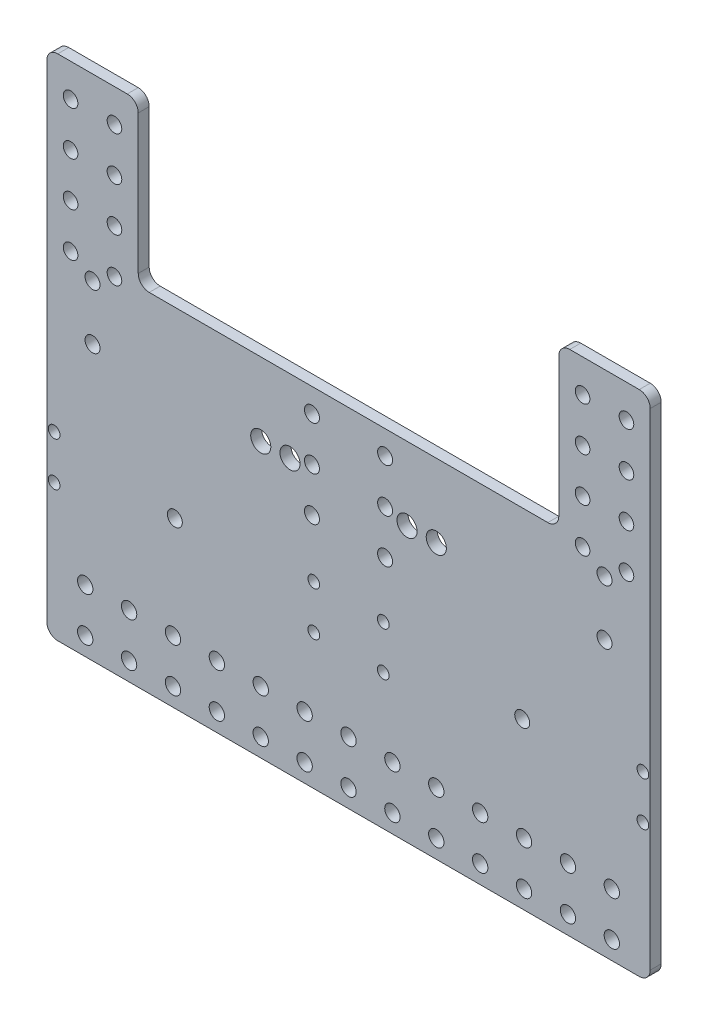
from build123d import *

# Parameters (mm, degrees)
SKETCH_1_W                = 165
SKETCH_1_H                = 430
SKETCH_1_R                = 2.05
EXTRUDE_1_DEPTH           = 3
CUT_EXTRUDE_1_DEPTH       = 231.304689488
CUT_EXTRUDE_1_DEPTH_BACK  = 231.304689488
SKETCH_2_R                = 1.6
SKETCH_6_W                = 77.5
SKETCH_6_H                = 180
EXTRUDE_2_DEPTH           = 3
FILLET_1_R                = 60
FILLET_2_R                = 20
FILLET_3_R                = 10
CUT_EXTRUDE_6_DEPTH       = 396.296091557
CUT_EXTRUDE_6_DEPTH_BACK  = 396.296091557
SKETCH_9_R                = 1.6
CUT_EXTRUDE_7_DEPTH       = 396.296091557
CUT_EXTRUDE_7_DEPTH_BACK  = 396.296091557
SKETCH_10_R               = 1.6
CUT_EXTRUDE_8_DEPTH       = 396.296091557
CUT_EXTRUDE_8_DEPTH_BACK  = 396.296091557
SKETCH_11_R               = 1.6
FILLET_4_R                = 30
CUT_EXTRUDE_10_DEPTH      = 396.296091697
CUT_EXTRUDE_10_DEPTH_BACK = 396.296091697
SKETCH_13_R               = 12.5
SKETCH_13_R_2             = 2.1
CUT_EXTRUDE_11_DEPTH      = 396.296091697
CUT_EXTRUDE_11_DEPTH_BACK = 396.296091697
SKETCH_16_R               = 1.55
CUT_EXTRUDE_13_DEPTH      = 10
SKETCH_17_R               = 1.55
SKETCH_17_R_2             = 2.05
CUT_EXTRUDE_14_DEPTH      = 10
CUT_EXTRUDE_15_DEPTH      = 10
FILLET_5_R                = 20
FILLET_6_R                = 80
SKETCH_19_R               = 1.35
CUT_EXTRUDE_17_DEPTH      = 64
SKETCH_20_W               = 150
SKETCH_20_H               = 100
CUT_EXTRUDE_18_DEPTH      = 64
SKETCH_21_R               = 2.05
CUT_EXTRUDE_19_DEPTH      = 10
SKETCH_22_R               = 2.05
CUT_EXTRUDE_20_DEPTH      = 10
SKETCH_23_R               = 2.05
EXTRUDE_3_DEPTH           = 3
SKETCH_24_W               = 512.492086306
SKETCH_24_H               = 521.810124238
CUT_EXTRUDE_21_DEPTH      = 10
SKETCH_25_R               = 2.05
CUT_EXTRUDE_22_DEPTH      = 10
SKETCH_28_R               = 1.55
CUT_EXTRUDE_24_DEPTH      = 10
SKETCH_30_W               = 626.634463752
SKETCH_30_H               = 370.284001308
SKETCH_30_W_2             = 165
SKETCH_30_H_2             = 104
CUT_EXTRUDE_26_DEPTH      = 10
SKETCH_31_R               = 2.1
CUT_EXTRUDE_27_DEPTH      = 10
SKETCH_32_W               = 165
SKETCH_32_H               = 20
CUT_EXTRUDE_28_DEPTH      = 10
SKETCH_33_W               = 25
SKETCH_33_H               = 25
EXTRUDE_4_DEPTH           = 3
SKETCH_34_R               = 2
CUT_EXTRUDE_29_DEPTH      = 10
SKETCH_41_R               = 2.75
CUT_EXTRUDE_30_DEPTH      = 3
SKETCH_47_W               = 165
SKETCH_47_H               = 30
SKETCH_47_R               = 2.1
EXTRUDE_7_DEPTH           = 3
SKETCH_49_R               = 2.05
CUT_EXTRUDE_34_DEPTH      = 10
SKETCH_50_R               = 2.05
EXTRUDE_8_DEPTH           = 3
SKETCH_51_W               = 115
SKETCH_51_H               = 19
CUT_EXTRUDE_35_DEPTH      = 10
FILLET_7_R                = 3
SKETCH_53_R               = 1.55
EXTRUDE_9_DEPTH           = 3
SKETCH_52_R               = 1.6
CUT_EXTRUDE_36_DEPTH      = 3


with BuildPart() as part:
    # Sketch 1 → Extrude 1 (new body)
    with BuildSketch(Plane.XY):
        Rectangle(SKETCH_1_W, SKETCH_1_H)
        with Locations((-70, 200)):
            Circle(SKETCH_1_R, mode=Mode.SUBTRACT)
        with Locations((-70, 185)):
            Circle(SKETCH_1_R, mode=Mode.SUBTRACT)
        with Locations(Location((70, 185, 0), (0, 0, 180))):
            Circle(SKETCH_1_R, mode=Mode.SUBTRACT)
        with Locations(Location((70, 200, 0), (0, 0, 180))):
            Circle(SKETCH_1_R, mode=Mode.SUBTRACT)
        with Locations(Location((-70, -185, 0), (0, 0, 180))):
            Circle(SKETCH_1_R, mode=Mode.SUBTRACT)
        with Locations(Location((-70, -200, 0), (0, 0, 180))):
            Circle(SKETCH_1_R, mode=Mode.SUBTRACT)
        with Locations((70, -200)):
            Circle(SKETCH_1_R, mode=Mode.SUBTRACT)
        with Locations((70, -185)):
            Circle(SKETCH_1_R, mode=Mode.SUBTRACT)
    extrude(amount=EXTRUDE_1_DEPTH)

    # Sketch 2 → Cut-Extrude 1 (cut, two sides: drawn at the far end of the back side and taken through both)
    with BuildSketch(Plane.XY.offset(3).offset(-CUT_EXTRUDE_1_DEPTH_BACK)):
        with Locations((-20.859650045, -20.859650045)):
            Circle(SKETCH_2_R)
        with Locations((-20.859650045, 20.859650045)):
            Circle(SKETCH_2_R)
        with Locations((20.859650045, 20.859650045)):
            Circle(SKETCH_2_R)
        with Locations((20.859650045, -20.859650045)):
            Circle(SKETCH_2_R)
    extrude(amount=CUT_EXTRUDE_1_DEPTH + CUT_EXTRUDE_1_DEPTH_BACK, mode=Mode.SUBTRACT)

    # Sketch 6 → Extrude 2 (add)
    with BuildSketch(Plane(origin=(0, 0, 0), x_dir=(-1, 0, 0), z_dir=(0, 0, -1))):
        Polygon((-82.5, 215), (82.5, 215), (82.5, 225), (200, 267), (200, 287), (-200, 287), (-200, 267), (-82.5, 225), align=None)
        with Locations((-121.25, 0)):
            Rectangle(SKETCH_6_W, SKETCH_6_H)
        with Locations((121.25, 0)):
            Rectangle(SKETCH_6_W, SKETCH_6_H)
        Polygon((82.5, -215), (82.5, -285), (225, -285), (225, -325), (-225, -325), (-225, -285), (-82.5, -285), (-82.5, -215), align=None)
    extrude(amount=-EXTRUDE_2_DEPTH)

    # Fillet 1
    fillet_1_edges = [part.edges().sort_by_distance(p)[0] for p in [
        (-82.5, -90, 1.5),
        (82.5, -90, 1.5),
    ]]
    fillet(fillet_1_edges, radius=FILLET_1_R)

    # Fillet 2
    fillet_2_edges = [part.edges().sort_by_distance(p)[0] for p in [
        (82.5, 225, 1.5),
        (-82.5, 225, 1.5),
    ]]
    fillet(fillet_2_edges, radius=FILLET_2_R)

    # Fillet 3
    fillet_3_edges = [part.edges().sort_by_distance(p)[0] for p in [
        (-225, -285, 1.5),
        (-225, -325, 1.5),
        (225, -325, 1.5),
        (225, -285, 1.5),
        (200, 267, 1.5),
        (200, 287, 1.5),
        (-200, 287, 1.5),
        (-200, 267, 1.5),
    ]]
    fillet(fillet_3_edges, radius=FILLET_3_R)

    # Sketch 9 → Cut-Extrude 6 (cut, two sides: drawn at the far end of the back side and taken through both)
    with BuildSketch(Plane(origin=(0, 0, 0), x_dir=(-1, 0, 0), z_dir=(0, 0, -1)).offset(-CUT_EXTRUDE_6_DEPTH_BACK)):
        with Locations((9, 169)):
            Circle(SKETCH_9_R)
        with Locations((-9, 169)):
            Circle(SKETCH_9_R)
        with Locations((-9, -169)):
            Circle(SKETCH_9_R)
        with Locations((9, -169)):
            Circle(SKETCH_9_R)
        with Locations((-119, 9)):
            Circle(SKETCH_9_R)
        with Locations((-119, -9)):
            Circle(SKETCH_9_R)
        with Locations((119, -9)):
            Circle(SKETCH_9_R)
        with Locations((119, 9)):
            Circle(SKETCH_9_R)
    extrude(amount=CUT_EXTRUDE_6_DEPTH + CUT_EXTRUDE_6_DEPTH_BACK, mode=Mode.SUBTRACT)

    # Sketch 10 → Cut-Extrude 7 (cut, two sides: drawn at the far end of the back side and taken through both)
    with BuildSketch(Plane(origin=(0, 0, 0), x_dir=(-1, 0, 0), z_dir=(0, 0, -1)).offset(-CUT_EXTRUDE_7_DEPTH_BACK)):
        with Locations((-32.5, 252)):
            Circle(SKETCH_10_R)
        with Locations((42.5, 252)):
            Circle(SKETCH_10_R)
        with Locations((-32.5, 230)):
            Circle(SKETCH_10_R)
        with Locations((42.5, 230)):
            Circle(SKETCH_10_R)
    extrude(amount=CUT_EXTRUDE_7_DEPTH + CUT_EXTRUDE_7_DEPTH_BACK, mode=Mode.SUBTRACT)

    # Sketch 11 → Cut-Extrude 8 (cut, two sides: drawn at the far end of the back side and taken through both)
    with BuildSketch(Plane(origin=(0, 0, 0), x_dir=(-1, 0, 0), z_dir=(0, 0, -1)).offset(-CUT_EXTRUDE_8_DEPTH_BACK)):
        with Locations((-67.5, 7.5)):
            Circle(SKETCH_11_R)
        with Locations((-52.5, 7.5)):
            Circle(SKETCH_11_R)
        with Locations((-52.5, -7.5)):
            Circle(SKETCH_11_R)
        with Locations((-67.5, -7.5)):
            Circle(SKETCH_11_R)
        with Locations((67.5, -7.5)):
            Circle(SKETCH_11_R)
        with Locations((52.5, -7.5)):
            Circle(SKETCH_11_R)
        with Locations((52.5, 7.5)):
            Circle(SKETCH_11_R)
        with Locations((67.5, 7.5)):
            Circle(SKETCH_11_R)
    extrude(amount=CUT_EXTRUDE_8_DEPTH + CUT_EXTRUDE_8_DEPTH_BACK, mode=Mode.SUBTRACT)

    # Fillet 4
    fillet_4_edges = [part.edges().sort_by_distance(p)[0] for p in [
        (160, -90, 1.5),
        (160, 90, 1.5),
        (-160, -90, 1.5),
        (-160, 90, 1.5),
    ]]
    fillet(fillet_4_edges, radius=FILLET_4_R)

    # Sketch 13 → Cut-Extrude 10 (cut, two sides: drawn at the far end of the back side and taken through both)
    with BuildSketch(Plane.XY.offset(3).offset(-CUT_EXTRUDE_10_DEPTH_BACK)):
        with Locations((0, 70)):
            Circle(SKETCH_13_R)
        with Locations((-20, 70)):
            Circle(SKETCH_13_R_2)
        with Locations(Location((20, 70, 0), (0, 0, 180))):
            Circle(SKETCH_13_R_2)
    extrude(amount=CUT_EXTRUDE_10_DEPTH + CUT_EXTRUDE_10_DEPTH_BACK, mode=Mode.SUBTRACT)

    # Sketch 14 → Cut-Extrude 11 (cut, two sides: drawn at the far end of the back side and taken through both)
    with BuildSketch(Plane.XY.offset(3).offset(-CUT_EXTRUDE_11_DEPTH_BACK)):
        with BuildLine():
            Line((105.5, 10), (105.5, -10))
            ThreePointArc((105.5, -10), (97.5, -18), (89.5, -10))
            Line((89.5, -10), (89.5, 10))
            ThreePointArc((89.5, 10), (97.5, 18), (105.5, 10))
        make_face()
        with BuildLine():
            Line((-105.5, 10), (-105.5, -10))
            ThreePointArc((-105.5, -10), (-97.5, -18), (-89.5, -10))
            Line((-89.5, -10), (-89.5, 10))
            ThreePointArc((-89.5, 10), (-97.5, 18), (-105.5, 10))
        make_face()
    extrude(amount=CUT_EXTRUDE_11_DEPTH + CUT_EXTRUDE_11_DEPTH_BACK, mode=Mode.SUBTRACT)

    # Sketch 16 → Cut-Extrude 13 (cut)
    with BuildSketch(Plane.XY.offset(3)):
        with Locations((-45, -75)):
            Circle(SKETCH_16_R)
        with Locations((45, -75)):
            Circle(SKETCH_16_R)
        with Locations((45, -175)):
            Circle(SKETCH_16_R)
        with Locations((-45, -175)):
            Circle(SKETCH_16_R)
    extrude(amount=-CUT_EXTRUDE_13_DEPTH, mode=Mode.SUBTRACT)

    # Sketch 17 → Cut-Extrude 14 (cut)
    with BuildSketch(Plane.XY.offset(3)):
        with Locations((-25, 217)):
            Circle(SKETCH_17_R)
        with Locations((25, 217)):
            Circle(SKETCH_17_R)
        with Locations((25, 167)):
            Circle(SKETCH_17_R)
        with Locations((-25, 167)):
            Circle(SKETCH_17_R)
        with Locations((-47.5, -265)):
            Circle(SKETCH_17_R_2)
        with Locations((47.5, -265)):
            Circle(SKETCH_17_R_2)
        with Locations((47.5, -240)):
            Circle(SKETCH_17_R_2)
        with Locations((-47.5, -240)):
            Circle(SKETCH_17_R_2)
        with Locations((-150, 47.063858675)):
            Circle(SKETCH_17_R_2)
        with Locations((-125, 47.063858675)):
            Circle(SKETCH_17_R_2)
        with Locations((-125, -47.936141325)):
            Circle(SKETCH_17_R_2)
        with Locations((-150, -47.936141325)):
            Circle(SKETCH_17_R_2)
        with Locations(Location((125, -47.936141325, 0), (0, 0, 180))):
            Circle(SKETCH_17_R_2)
        with Locations(Location((150, -47.936141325, 0), (0, 0, 180))):
            Circle(SKETCH_17_R_2)
        with Locations(Location((150, 47.063858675, 0), (0, 0, 180))):
            Circle(SKETCH_17_R_2)
        with Locations(Location((125, 47.063858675, 0), (0, 0, 180))):
            Circle(SKETCH_17_R_2)
        with Locations(Location((70, 175, 0), (0, 0, 180))):
            Circle(SKETCH_17_R_2)
        with Locations(Location((70, 160, 0), (0, 0, 180))):
            Circle(SKETCH_17_R_2)
        with Locations((-70, 160)):
            Circle(SKETCH_17_R_2)
        with Locations((-70, 175)):
            Circle(SKETCH_17_R_2)
    extrude(amount=-CUT_EXTRUDE_14_DEPTH, mode=Mode.SUBTRACT)

    # Sketch 18 → Cut-Extrude 15 (cut)
    with BuildSketch(Plane.XY.offset(3)):
        Polygon((-100, -325), (100, -325), (71.132486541, -275), (-71.132486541, -275), align=None)
    extrude(amount=-CUT_EXTRUDE_15_DEPTH, mode=Mode.SUBTRACT)

    # Fillet 5
    fillet_5_edges = [part.edges().sort_by_distance(p)[0] for p in [
        (100, -325, 1.5),
        (-100, -325, 1.5),
        (-71.132486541, -275, 1.5),
        (71.132486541, -275, 1.5),
    ]]
    fillet(fillet_5_edges, radius=FILLET_5_R)

    # Fillet 6
    fillet_6_edges = [part.edges().sort_by_distance(p)[0] for p in [
        (-82.5, -285, 1.5),
        (82.5, -285, 1.5),
    ]]
    fillet(fillet_6_edges, radius=FILLET_6_R)

    # Sketch 19 → Cut-Extrude 17 (cut)
    with BuildSketch(Plane.XY.offset(3)):
        with Locations((51.8, -12.8)):
            Circle(SKETCH_19_R)
        with Locations((-51.8, -12.8)):
            Circle(SKETCH_19_R)
        with Locations((-51.8, 90.8)):
            Circle(SKETCH_19_R)
        with Locations((51.8, 90.8)):
            Circle(SKETCH_19_R)
    extrude(amount=-CUT_EXTRUDE_17_DEPTH, mode=Mode.SUBTRACT)

    # Sketch 20 → Cut-Extrude 18 (cut)
    with BuildSketch(Plane(origin=(0, 0, 0), x_dir=(-1, 0, 0), z_dir=(0, 0, -1))):
        with Locations((0, -15)):
            Rectangle(SKETCH_20_W, SKETCH_20_H)
    extrude(amount=-CUT_EXTRUDE_18_DEPTH, mode=Mode.SUBTRACT)

    # Sketch 21 → Cut-Extrude 19 (cut)
    with BuildSketch(Plane(origin=(0, 0, 0), x_dir=(-1, 0, 0), z_dir=(0, 0, -1))):
        with Locations((-10, -196.5)):
            Circle(SKETCH_21_R)
        with Locations((10, -196.5)):
            Circle(SKETCH_21_R)
        with Locations((10, -208.5)):
            Circle(SKETCH_21_R)
        with Locations((-10, -208.5)):
            Circle(SKETCH_21_R)
    extrude(amount=-CUT_EXTRUDE_19_DEPTH, mode=Mode.SUBTRACT)

    # Sketch 22 → Cut-Extrude 20 (cut)
    with BuildSketch(Plane.XY.offset(3)):
        with Locations((-76, 209)):
            Circle(SKETCH_22_R)
        with Locations(Location((-64, 209, 0), (0, 0, 180))):
            Circle(SKETCH_22_R)
        with Locations(Location((76, 209, 0), (0, 0, 180))):
            Circle(SKETCH_22_R)
        with Locations((64, 209)):
            Circle(SKETCH_22_R)
        with Locations((-76, 197)):
            Circle(SKETCH_22_R)
        with Locations(Location((-64, 197, 0), (0, 0, 180))):
            Circle(SKETCH_22_R)
        with Locations((64, 197)):
            Circle(SKETCH_22_R)
        with Locations(Location((76, 197, 0), (0, 0, 180))):
            Circle(SKETCH_22_R)
        with Locations((-76, 185)):
            Circle(SKETCH_22_R)
        with Locations(Location((-64, 185, 0), (0, 0, 180))):
            Circle(SKETCH_22_R)
        with Locations((64, 185)):
            Circle(SKETCH_22_R)
        with Locations(Location((76, 185, 0), (0, 0, 180))):
            Circle(SKETCH_22_R)
        with Locations((-76, 173)):
            Circle(SKETCH_22_R)
        with Locations(Location((-64, 173, 0), (0, 0, 180))):
            Circle(SKETCH_22_R)
        with Locations((64, 173)):
            Circle(SKETCH_22_R)
        with Locations(Location((76, 173, 0), (0, 0, 180))):
            Circle(SKETCH_22_R)
        with Locations((-76, 161)):
            Circle(SKETCH_22_R)
        with Locations(Location((-64, 161, 0), (0, 0, 180))):
            Circle(SKETCH_22_R)
        with Locations((64, 161)):
            Circle(SKETCH_22_R)
        with Locations(Location((76, 161, 0), (0, 0, 180))):
            Circle(SKETCH_22_R)
        with Locations((-76, 149)):
            Circle(SKETCH_22_R)
        with Locations(Location((-64, 149, 0), (0, 0, 180))):
            Circle(SKETCH_22_R)
        with Locations((64, 149)):
            Circle(SKETCH_22_R)
        with Locations(Location((76, 149, 0), (0, 0, 180))):
            Circle(SKETCH_22_R)
        with Locations((-76, 137)):
            Circle(SKETCH_22_R)
        with Locations(Location((-64, 137, 0), (0, 0, 180))):
            Circle(SKETCH_22_R)
        with Locations((64, 137)):
            Circle(SKETCH_22_R)
        with Locations(Location((76, 137, 0), (0, 0, 180))):
            Circle(SKETCH_22_R)
        with Locations((-76, 125)):
            Circle(SKETCH_22_R)
        with Locations(Location((-64, 125, 0), (0, 0, 180))):
            Circle(SKETCH_22_R)
        with Locations((64, 125)):
            Circle(SKETCH_22_R)
        with Locations(Location((76, 125, 0), (0, 0, 180))):
            Circle(SKETCH_22_R)
    extrude(amount=-CUT_EXTRUDE_20_DEPTH, mode=Mode.SUBTRACT)

    # Sketch 23 → Extrude 3 (add)
    with BuildSketch(Plane.XY.offset(3)):
        with Locations((70, 200)):
            Circle(SKETCH_23_R)
        with Locations((70, 185)):
            Circle(SKETCH_23_R)
        with Locations((70, 175)):
            Circle(SKETCH_23_R)
        with Locations((70, 160)):
            Circle(SKETCH_23_R)
        with Locations((-70, 160)):
            Circle(SKETCH_23_R)
        with Locations((-70, 175)):
            Circle(SKETCH_23_R)
        with Locations((-70, 185)):
            Circle(SKETCH_23_R)
        with Locations((-70, 200)):
            Circle(SKETCH_23_R)
    extrude(amount=-EXTRUDE_3_DEPTH)

    # Sketch 24 → Cut-Extrude 21 (cut)
    with BuildSketch(Plane.XY.offset(3)):
        with Locations((3.494264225, 89.905062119)):
            Rectangle(SKETCH_24_W, SKETCH_24_H)
    extrude(amount=-CUT_EXTRUDE_21_DEPTH, mode=Mode.SUBTRACT)

    # Sketch 25 → Cut-Extrude 22 (cut)
    with BuildSketch(Plane.XY.offset(3)):
        with Locations((-10, -220.5)):
            Circle(SKETCH_25_R)
        with Locations(Location((10, -220.5, 0), (0, 0, 180))):
            Circle(SKETCH_25_R)
    extrude(amount=-CUT_EXTRUDE_22_DEPTH, mode=Mode.SUBTRACT)

    # Sketch 28 → Cut-Extrude 24 (cut)
    with BuildSketch(Plane(origin=(0, 0, 0), x_dir=(-1, 0, 0), z_dir=(0, 0, -1))):
        with Locations((-75, -231)):
            Circle(SKETCH_28_R)
        with Locations((-65, -231)):
            Circle(SKETCH_28_R)
        with Locations((75, -231)):
            Circle(SKETCH_28_R)
        with Locations((65, -231)):
            Circle(SKETCH_28_R)
    extrude(amount=-CUT_EXTRUDE_24_DEPTH, mode=Mode.SUBTRACT)

    # Sketch 30 → Cut-Extrude 26 (cut)
    with BuildSketch(Plane(origin=(0, 0, 0), x_dir=(-1, 0, 0), z_dir=(0, 0, -1))):
        with Locations((-6.795654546, -266.39157742)):
            Rectangle(SKETCH_30_W, SKETCH_30_H)
        with Locations((0, -223)):
            Rectangle(SKETCH_30_W_2, SKETCH_30_H_2, mode=Mode.SUBTRACT)
    extrude(amount=-CUT_EXTRUDE_26_DEPTH, mode=Mode.SUBTRACT)

    # Sketch 31 → Cut-Extrude 27 (cut)
    with BuildSketch(Plane(origin=(0, 0, 0), x_dir=(-1, 0, 0), z_dir=(0, 0, -1))):
        with Locations((-76.5, -269)):
            Circle(SKETCH_31_R)
        with Locations((-64.5, -269)):
            Circle(SKETCH_31_R)
        with Locations((-64.5, -259)):
            Circle(SKETCH_31_R)
        with Locations((-76.5, -259)):
            Circle(SKETCH_31_R)
        with Locations((-28.5, -269)):
            Circle(SKETCH_31_R)
        with Locations((-16.5, -269)):
            Circle(SKETCH_31_R)
        with Locations((-16.5, -259)):
            Circle(SKETCH_31_R)
        with Locations((-28.5, -259)):
            Circle(SKETCH_31_R)
        with Locations((76.5, -259)):
            Circle(SKETCH_31_R)
        with Locations((64.5, -259)):
            Circle(SKETCH_31_R)
        with Locations((64.5, -269)):
            Circle(SKETCH_31_R)
        with Locations((76.5, -269)):
            Circle(SKETCH_31_R)
        with Locations((28.5, -259)):
            Circle(SKETCH_31_R)
        with Locations((16.5, -259)):
            Circle(SKETCH_31_R)
        with Locations((16.5, -269)):
            Circle(SKETCH_31_R)
        with Locations((28.5, -269)):
            Circle(SKETCH_31_R)
    extrude(amount=-CUT_EXTRUDE_27_DEPTH, mode=Mode.SUBTRACT)

    # Sketch 32 → Cut-Extrude 28 (cut)
    with BuildSketch(Plane.XY.offset(3)):
        with Locations((0, -265)):
            Rectangle(SKETCH_32_W, SKETCH_32_H)
    extrude(amount=-CUT_EXTRUDE_28_DEPTH, mode=Mode.SUBTRACT)

    # Sketch 33 → Extrude 4 (add)
    with BuildSketch(Plane.XY.offset(3)):
        with Locations((-70, -158.5)):
            Rectangle(SKETCH_33_W, SKETCH_33_H)
        with Locations((70, -158.5)):
            Rectangle(SKETCH_33_W, SKETCH_33_H)
    extrude(amount=-EXTRUDE_4_DEPTH)

    # Sketch 34 → Cut-Extrude 29 (cut)
    with BuildSketch(Plane.XY.offset(3)):
        with Locations((-76, -155)):
            Circle(SKETCH_34_R)
        with Locations((-64, -155)):
            Circle(SKETCH_34_R)
        with Locations(Location((64, -155, 0), (0, 0, 180))):
            Circle(SKETCH_34_R)
        with Locations(Location((76, -155, 0), (0, 0, 180))):
            Circle(SKETCH_34_R)
        with Locations(Location((64, -167, 0), (0, 0, 180))):
            Circle(SKETCH_34_R)
        with Locations(Location((76, -167, 0), (0, 0, 180))):
            Circle(SKETCH_34_R)
        with Locations((-76, -167)):
            Circle(SKETCH_34_R)
        with Locations((-64, -167)):
            Circle(SKETCH_34_R)
        with Locations(Location((64, -179, 0), (0, 0, 180))):
            Circle(SKETCH_34_R)
        with Locations(Location((76, -179, 0), (0, 0, 180))):
            Circle(SKETCH_34_R)
        with Locations((-76, -179)):
            Circle(SKETCH_34_R)
        with Locations((-64, -179)):
            Circle(SKETCH_34_R)
        with Locations(Location((64, -191, 0), (0, 0, 180))):
            Circle(SKETCH_34_R)
        with Locations(Location((76, -191, 0), (0, 0, 180))):
            Circle(SKETCH_34_R)
        with Locations((-76, -191)):
            Circle(SKETCH_34_R)
        with Locations((-64, -191)):
            Circle(SKETCH_34_R)
    extrude(amount=-CUT_EXTRUDE_29_DEPTH, mode=Mode.SUBTRACT)

    # Sketch 41 → Cut-Extrude 30 (cut)
    with BuildSketch(Plane.XY.offset(3)):
        with Locations((-24, -210)):
            Circle(SKETCH_41_R)
        with Locations((-16, -210)):
            Circle(SKETCH_41_R)
        with Locations((16, -210)):
            Circle(SKETCH_41_R)
        with Locations((24, -210)):
            Circle(SKETCH_41_R)
    extrude(amount=-CUT_EXTRUDE_30_DEPTH, mode=Mode.SUBTRACT)

    # Sketch 47 → Extrude 7 (add)
    with BuildSketch(Plane.XY.offset(3)):
        with Locations((0, -270)):
            Rectangle(SKETCH_47_W, SKETCH_47_H)
        with Locations((-72, -280)):
            Circle(SKETCH_47_R, mode=Mode.SUBTRACT)
        with Locations((-60, -280)):
            Circle(SKETCH_47_R, mode=Mode.SUBTRACT)
        with Locations((-48, -280)):
            Circle(SKETCH_47_R, mode=Mode.SUBTRACT)
        with Locations((-36, -280)):
            Circle(SKETCH_47_R, mode=Mode.SUBTRACT)
        with Locations((-24, -280)):
            Circle(SKETCH_47_R, mode=Mode.SUBTRACT)
        with Locations((-12, -280)):
            Circle(SKETCH_47_R, mode=Mode.SUBTRACT)
        with Locations((0, -280)):
            Circle(SKETCH_47_R, mode=Mode.SUBTRACT)
        with Locations((12, -280)):
            Circle(SKETCH_47_R, mode=Mode.SUBTRACT)
        with Locations((24, -280)):
            Circle(SKETCH_47_R, mode=Mode.SUBTRACT)
        with Locations((36, -280)):
            Circle(SKETCH_47_R, mode=Mode.SUBTRACT)
        with Locations((48, -280)):
            Circle(SKETCH_47_R, mode=Mode.SUBTRACT)
        with Locations((60, -280)):
            Circle(SKETCH_47_R, mode=Mode.SUBTRACT)
        with Locations((72, -280)):
            Circle(SKETCH_47_R, mode=Mode.SUBTRACT)
        with Locations((-60, -268)):
            Circle(SKETCH_47_R, mode=Mode.SUBTRACT)
        with Locations((-48, -268)):
            Circle(SKETCH_47_R, mode=Mode.SUBTRACT)
        with Locations((-36, -268)):
            Circle(SKETCH_47_R, mode=Mode.SUBTRACT)
        with Locations((-24, -268)):
            Circle(SKETCH_47_R, mode=Mode.SUBTRACT)
        with Locations((-12, -268)):
            Circle(SKETCH_47_R, mode=Mode.SUBTRACT)
        with Locations((0, -268)):
            Circle(SKETCH_47_R, mode=Mode.SUBTRACT)
        with Locations((12, -268)):
            Circle(SKETCH_47_R, mode=Mode.SUBTRACT)
        with Locations((24, -268)):
            Circle(SKETCH_47_R, mode=Mode.SUBTRACT)
        with Locations((36, -268)):
            Circle(SKETCH_47_R, mode=Mode.SUBTRACT)
        with Locations((48, -268)):
            Circle(SKETCH_47_R, mode=Mode.SUBTRACT)
        with Locations((60, -268)):
            Circle(SKETCH_47_R, mode=Mode.SUBTRACT)
        with Locations((72, -268)):
            Circle(SKETCH_47_R, mode=Mode.SUBTRACT)
        with Locations((-72, -268)):
            Circle(SKETCH_47_R, mode=Mode.SUBTRACT)
    extrude(amount=-EXTRUDE_7_DEPTH)

    # Sketch 49 → Cut-Extrude 34 (cut)
    with BuildSketch(Plane(origin=(0, 0, 0), x_dir=(-1, 0, 0), z_dir=(0, 0, -1))):
        with Locations((70, -195)):
            Circle(SKETCH_49_R)
        with Locations((70, -210)):
            Circle(SKETCH_49_R)
        with Locations((-70, -210)):
            Circle(SKETCH_49_R)
        with Locations((-70, -195)):
            Circle(SKETCH_49_R)
    extrude(amount=-CUT_EXTRUDE_34_DEPTH, mode=Mode.SUBTRACT)

    # Sketch 50 → Extrude 8 (add)
    with BuildSketch(Plane(origin=(0, 0, 0), x_dir=(-1, 0, 0), z_dir=(0, 0, -1))):
        with Locations((70, -200)):
            Circle(SKETCH_50_R)
        with Locations((70, -185)):
            Circle(SKETCH_50_R)
        with Locations((-70, -200)):
            Circle(SKETCH_50_R)
        with Locations((-70, -185)):
            Circle(SKETCH_50_R)
    extrude(amount=-EXTRUDE_8_DEPTH)

    # Sketch 51 → Cut-Extrude 35 (cut)
    with BuildSketch(Plane(origin=(0, 0, 0), x_dir=(-1, 0, 0), z_dir=(0, 0, -1))):
        with Locations((0, -180.5)):
            Rectangle(SKETCH_51_W, SKETCH_51_H)
    extrude(amount=-CUT_EXTRUDE_35_DEPTH, mode=Mode.SUBTRACT)

    # Fillet 7
    fillet_7_edges = [part.edges().sort_by_distance(p)[0] for p in [
        (-57.5, -146, 1.5),
        (-82.5, -146, 1.5),
        (57.5, -146, 1.5),
        (82.5, -146, 1.5),
        (-82.5, -285, 1.5),
        (82.5, -285, 1.5),
        (-57.5, -190, 1.5),
        (57.5, -190, 1.5),
    ]]
    fillet(fillet_7_edges, radius=FILLET_7_R)

    # Sketch 53 → Extrude 9 (add)
    with BuildSketch(Plane(origin=(0, 0, 0), x_dir=(-1, 0, 0), z_dir=(0, 0, -1))):
        with Locations((75, -231)):
            Circle(SKETCH_53_R)
        with Locations((65, -231)):
            Circle(SKETCH_53_R)
        with Locations((-65, -231)):
            Circle(SKETCH_53_R)
        with Locations((-75, -231)):
            Circle(SKETCH_53_R)
    extrude(amount=-EXTRUDE_9_DEPTH)

    # Sketch 52 → Cut-Extrude 36 (cut)
    with BuildSketch(Plane(origin=(0, 0, 0), x_dir=(-1, 0, 0), z_dir=(0, 0, -1))):
        with Locations((-80.5, -236)):
            Circle(SKETCH_52_R)
        with Locations((-9.5, -236)):
            Circle(SKETCH_52_R)
        with Locations((-9.5, -248)):
            Circle(SKETCH_52_R)
        with Locations((-80.5, -248)):
            Circle(SKETCH_52_R)
        with Locations(Location((9.5, -248, 0), (0, 0, 180))):
            Circle(SKETCH_52_R)
        with Locations(Location((80.5, -248, 0), (0, 0, 180))):
            Circle(SKETCH_52_R)
        with Locations(Location((9.5, -236, 0), (0, 0, 180))):
            Circle(SKETCH_52_R)
        with Locations(Location((80.5, -236, 0), (0, 0, 180))):
            Circle(SKETCH_52_R)
    extrude(amount=-CUT_EXTRUDE_36_DEPTH, mode=Mode.SUBTRACT)


solid = part.part
